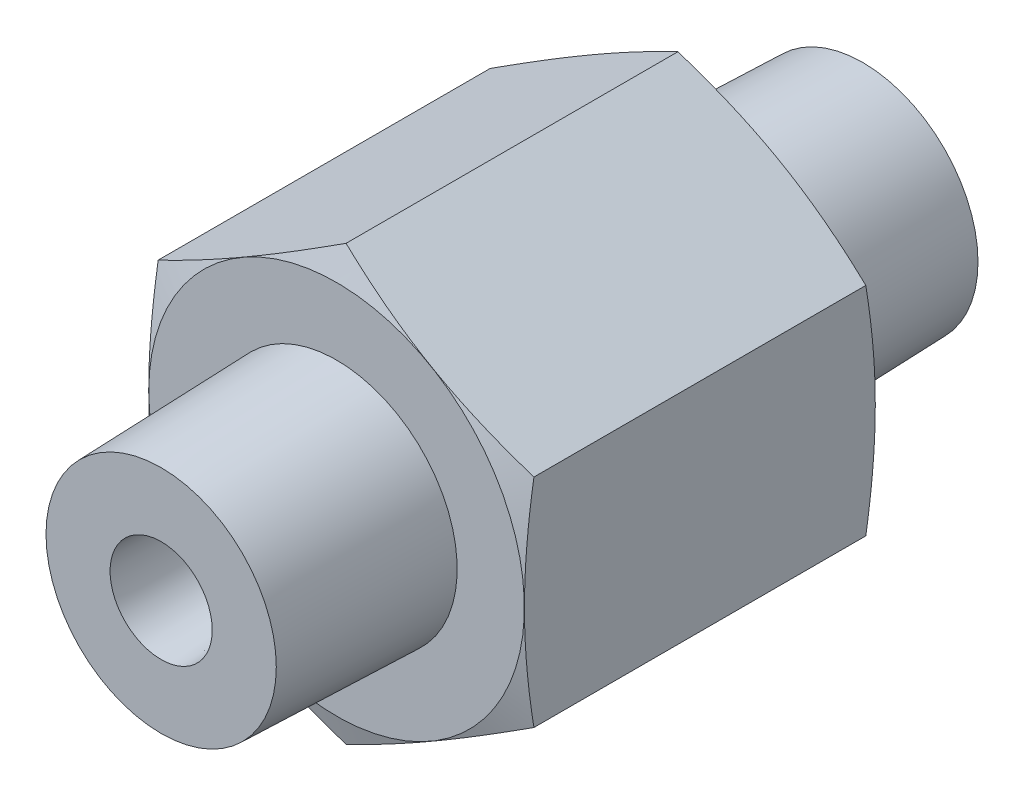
ISO-10303-21;
HEADER;
FILE_DESCRIPTION(('STEP AP214'),'2;1');
FILE_NAME('part.step','',(''),(''),'','','');
FILE_SCHEMA(('AUTOMOTIVE_DESIGN { 1 0 10303 214 1 1 1 1 }'));
ENDSEC;
DATA;
#1=APPLICATION_CONTEXT('core data for automotive mechanical design processes');
#2=APPLICATION_PROTOCOL_DEFINITION('international standard','automotive_design',2000,#1);
#3=PRODUCT_CONTEXT('',#1,'mechanical');
#4=PRODUCT('Part','Part','',(#3));
#5=PRODUCT_RELATED_PRODUCT_CATEGORY('part','',(#4));
#6=PRODUCT_DEFINITION_FORMATION('','',#4);
#7=PRODUCT_DEFINITION_CONTEXT('part definition',#1,'design');
#8=PRODUCT_DEFINITION('design','',#6,#7);
#9=PRODUCT_DEFINITION_SHAPE('','',#8);
#10=(LENGTH_UNIT() NAMED_UNIT(*) SI_UNIT(.MILLI.,.METRE.));
#11=(NAMED_UNIT(*) PLANE_ANGLE_UNIT() SI_UNIT($,.RADIAN.));
#12=(NAMED_UNIT(*) SI_UNIT($,.STERADIAN.) SOLID_ANGLE_UNIT());
#13=UNCERTAINTY_MEASURE_WITH_UNIT(LENGTH_MEASURE(1.E-05),#10,'distance_accuracy_value','');
#14=(GEOMETRIC_REPRESENTATION_CONTEXT(3) GLOBAL_UNCERTAINTY_ASSIGNED_CONTEXT((#13)) GLOBAL_UNIT_ASSIGNED_CONTEXT((#10,
#11,#12)) REPRESENTATION_CONTEXT('',''));
#15=CARTESIAN_POINT('',(0.,0.,0.));
#16=DIRECTION('',(0.,0.,1.));
#17=DIRECTION('',(1.,0.,0.));
#18=AXIS2_PLACEMENT_3D('',#15,#16,#17);
#19=CARTESIAN_POINT('',(-6.03249999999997,-33.4507708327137,0.));
#20=DIRECTION('',(0.5,-0.866025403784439,0.));
#21=DIRECTION('',(0.866025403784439,0.5,0.));
#22=AXIS2_PLACEMENT_3D('',#19,#20,#21);
#23=PLANE('',#22);
#24=CARTESIAN_POINT('',(-12.8328840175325,-37.3769743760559,12.3564425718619));
#25=CARTESIAN_POINT('',(-12.5509277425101,-37.2141868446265,12.4095177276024));
#26=CARTESIAN_POINT('',(-12.2682212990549,-37.0509662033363,12.4577566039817));
#27=CARTESIAN_POINT('',(-11.7013331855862,-36.7236731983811,12.5425743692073));
#28=CARTESIAN_POINT('',(-11.4171507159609,-36.55960037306,12.5791460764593));
#29=CARTESIAN_POINT('',(-10.8498479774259,-36.2320679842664,12.6383459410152));
#30=CARTESIAN_POINT('',(-10.5667360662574,-36.0686132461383,12.6610780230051));
#31=CARTESIAN_POINT('',(-9.99997999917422,-35.7413964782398,12.6915643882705));
#32=CARTESIAN_POINT('',(-9.71633602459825,-35.5776345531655,12.6993230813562));
#33=CARTESIAN_POINT('',(-9.14904807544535,-35.2501107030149,12.6993230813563));
#34=CARTESIAN_POINT('',(-8.86540410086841,-35.0863487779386,12.6915643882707));
#35=CARTESIAN_POINT('',(-8.29864803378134,-34.7591320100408,12.661078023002));
#36=CARTESIAN_POINT('',(-8.01553612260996,-34.5956772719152,12.6383459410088));
#37=CARTESIAN_POINT('',(-7.4482333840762,-34.2681448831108,12.5791460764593));
#38=CARTESIAN_POINT('',(-7.16405091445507,-34.1040720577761,12.542574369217));
#39=CARTESIAN_POINT('',(-6.5971628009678,-33.7767790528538,12.4577566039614));
#40=CARTESIAN_POINT('',(-6.31445635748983,-33.6135584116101,12.4095177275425));
#41=CARTESIAN_POINT('',(-6.03250008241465,-33.4507708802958,12.3564425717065));
#42=B_SPLINE_CURVE_WITH_KNOTS('',3,(#24,#25,#26,#27,#28,#29,#30,#31,#32,#33,#34,#35,#36,#37,#38,
#39,#40,#41),.UNSPECIFIED.,.F.,.F.,(4,2,2,2,2,2,2,2,4),(0.,0.989698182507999,1.9800043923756,
2.96277938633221,3.94526489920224,4.9277504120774,5.91052540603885,6.90083161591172,
7.89052979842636),.UNSPECIFIED.);
#43=CARTESIAN_POINT('',(-12.8328840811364,-37.3769744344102,12.3564425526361));
#44=VERTEX_POINT('',#43);
#45=CARTESIAN_POINT('',(-6.03250004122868,-33.4507708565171,12.3564425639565));
#46=VERTEX_POINT('',#45);
#47=EDGE_CURVE('E20',#44,#46,#42,.T.);
#48=ORIENTED_EDGE('',*,*,#47,.F.);
#49=DIRECTION('',(0.,0.,1.));
#50=VECTOR('',#49,1.);
#51=CARTESIAN_POINT('',(-12.8328841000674,-37.3769744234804,0.));
#52=LINE('',#51,#50);
#53=CARTESIAN_POINT('',(-12.8328840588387,-37.376974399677,0.343557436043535));
#54=VERTEX_POINT('',#53);
#55=EDGE_CURVE('E72',#54,#44,#52,.T.);
#56=ORIENTED_EDGE('',*,*,#55,.F.);
#57=CARTESIAN_POINT('',(-6.0325000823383,-33.4507708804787,0.343557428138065));
#58=CARTESIAN_POINT('',(-6.31445635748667,-33.6135584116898,0.290482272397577));
#59=CARTESIAN_POINT('',(-6.59716280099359,-33.7767790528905,0.242243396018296));
#60=CARTESIAN_POINT('',(-7.1640509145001,-34.1040720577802,0.157425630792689));
#61=CARTESIAN_POINT('',(-7.44823338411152,-34.2681448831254,0.120853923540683));
#62=CARTESIAN_POINT('',(-8.01553612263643,-34.5956772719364,0.0616540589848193));
#63=CARTESIAN_POINT('',(-8.29864803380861,-34.7591320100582,0.0389219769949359));
#64=CARTESIAN_POINT('',(-8.86540410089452,-35.086348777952,0.00843561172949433));
#65=CARTESIAN_POINT('',(-9.1490480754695,-35.250110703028,0.000676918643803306));
#66=CARTESIAN_POINT('',(-9.71633602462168,-35.5776345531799,0.000676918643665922));
#67=CARTESIAN_POINT('',(-9.99997999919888,-35.7413964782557,0.00843561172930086));
#68=CARTESIAN_POINT('',(-10.5667360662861,-36.0686132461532,0.0389219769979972));
#69=CARTESIAN_POINT('',(-10.8498479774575,-36.2320679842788,0.0616540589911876));
#70=CARTESIAN_POINT('',(-11.4171507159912,-36.5596003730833,0.120853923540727));
#71=CARTESIAN_POINT('',(-11.7013331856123,-36.723673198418,0.157425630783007));
#72=CARTESIAN_POINT('',(-12.2682212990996,-37.0509662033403,0.242243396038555));
#73=CARTESIAN_POINT('',(-12.5509277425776,-37.2141868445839,0.29048227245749));
#74=CARTESIAN_POINT('',(-12.8328840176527,-37.3769743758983,0.343557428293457));
#75=B_SPLINE_CURVE_WITH_KNOTS('',3,(#57,#58,#59,#60,#61,#62,#63,#64,#65,#66,#67,#68,#69,#70,#71,
#72,#73,#74),.UNSPECIFIED.,.F.,.F.,(4,2,2,2,2,2,2,2,4),(0.,0.989698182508,1.9800043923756,
2.96277938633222,3.94526489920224,4.9277504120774,5.91052540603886,6.90083161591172,
7.89052979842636),.UNSPECIFIED.);
#76=CARTESIAN_POINT('',(-6.03249999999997,-33.4507708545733,0.343557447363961));
#77=VERTEX_POINT('',#76);
#78=EDGE_CURVE('E89',#77,#54,#75,.T.);
#79=ORIENTED_EDGE('',*,*,#78,.F.);
#80=DIRECTION('',(0.,0.,-1.));
#81=VECTOR('',#80,1.);
#82=CARTESIAN_POINT('',(-6.03249999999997,-33.4507708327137,0.));
#83=LINE('',#82,#81);
#84=EDGE_CURVE('E87',#46,#77,#83,.T.);
#85=ORIENTED_EDGE('',*,*,#84,.F.);
#86=EDGE_LOOP('',(#48,#56,#79,#85));
#87=FACE_BOUND('',#86,.T.);
#88=ADVANCED_FACE('F16',(#87),#23,.T.);
#89=CARTESIAN_POINT('',(-12.8328841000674,-37.3769744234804,0.));
#90=DIRECTION('',(-0.5,-0.866025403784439,0.));
#91=DIRECTION('',(0.866025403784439,-0.5,0.));
#92=AXIS2_PLACEMENT_3D('',#89,#90,#91);
#93=PLANE('',#92);
#94=CARTESIAN_POINT('',(-19.6332682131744,-33.4507707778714,12.3564425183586));
#95=CARTESIAN_POINT('',(-19.351311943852,-33.6135583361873,12.4095176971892));
#96=CARTESIAN_POINT('',(-19.0686054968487,-33.7767789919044,12.4577565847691));
#97=CARTESIAN_POINT('',(-18.5017173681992,-34.1040720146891,12.5425743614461));
#98=CARTESIAN_POINT('',(-18.2175348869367,-34.2681448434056,12.5791460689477));
#99=CARTESIAN_POINT('',(-17.6502321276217,-34.5956772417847,12.6383459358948));
#100=CARTESIAN_POINT('',(-17.367120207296,-34.7591319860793,12.6610780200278));
#101=CARTESIAN_POINT('',(-16.8003641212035,-35.0863487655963,12.6915643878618));
#102=CARTESIAN_POINT('',(-16.5167201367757,-35.2501106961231,12.6993230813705));
#103=CARTESIAN_POINT('',(-15.9494321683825,-35.5776345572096,12.699323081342));
#104=CARTESIAN_POINT('',(-15.6657881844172,-35.7413964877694,12.6915643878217));
#105=CARTESIAN_POINT('',(-15.099032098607,-36.0686132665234,12.6610780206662));
#106=CARTESIAN_POINT('',(-14.8159201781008,-36.2320680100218,12.6383459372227));
#107=CARTESIAN_POINT('',(-14.2486174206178,-36.5596004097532,12.5791460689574));
#108=CARTESIAN_POINT('',(-13.9644349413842,-36.723673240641,12.5425743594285));
#109=CARTESIAN_POINT('',(-13.3975468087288,-37.0509662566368,12.4577565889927));
#110=CARTESIAN_POINT('',(-13.1148403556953,-37.2141869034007,12.4095177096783));
#111=CARTESIAN_POINT('',(-12.8328840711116,-37.3769744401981,12.3564425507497));
#112=B_SPLINE_CURVE_WITH_KNOTS('',3,(#94,#95,#96,#97,#98,#99,#100,#101,#102,#103,#104,#105,#106,
#107,#108,#109,#110,#111),.UNSPECIFIED.,.F.,.F.,(4,2,2,2,2,2,2,2,4),(0.,0.989698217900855,
1.98000446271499,2.96277949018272,3.94526503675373,4.92775058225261,5.91052560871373,
6.90083185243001,7.89053006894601),.UNSPECIFIED.);
#113=CARTESIAN_POINT('',(-19.6332682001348,-33.4507707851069,12.3564425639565));
#114=VERTEX_POINT('',#113);
#115=EDGE_CURVE('E85',#114,#44,#112,.T.);
#116=ORIENTED_EDGE('',*,*,#115,.F.);
#117=DIRECTION('',(0.,0.,1.));
#118=VECTOR('',#117,1.);
#119=CARTESIAN_POINT('',(-19.6332682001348,-33.4507708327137,0.));
#120=LINE('',#119,#118);
#121=CARTESIAN_POINT('',(-19.6332681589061,-33.4507708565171,0.343557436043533));
#122=VERTEX_POINT('',#121);
#123=EDGE_CURVE('E187',#122,#114,#120,.T.);
#124=ORIENTED_EDGE('',*,*,#123,.F.);
#125=CARTESIAN_POINT('',(-12.8328840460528,-37.376974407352,0.343557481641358));
#126=CARTESIAN_POINT('',(-13.1148403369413,-37.2141868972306,0.290482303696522));
#127=CARTESIAN_POINT('',(-13.3975467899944,-37.0509662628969,0.242243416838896));
#128=CARTESIAN_POINT('',(-13.9644349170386,-36.723673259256,0.157425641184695));
#129=CARTESIAN_POINT('',(-14.2486173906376,-36.5596004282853,0.120853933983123));
#130=CARTESIAN_POINT('',(-14.8159201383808,-36.2320680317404,0.0616540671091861));
#131=CARTESIAN_POINT('',(-15.0990320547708,-36.0686132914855,0.0389219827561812));
#132=CARTESIAN_POINT('',(-15.6657881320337,-35.7413965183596,0.0084356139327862));
#133=CARTESIAN_POINT('',(-15.9494321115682,-35.5776345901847,0.000676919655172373));
#134=CARTESIAN_POINT('',(-16.5167200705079,-35.2501107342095,0.000676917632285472));
#135=CARTESIAN_POINT('',(-16.8003640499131,-35.0863488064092,0.00843560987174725));
#136=CARTESIAN_POINT('',(-17.367120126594,-34.7591320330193,0.0389219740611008));
#137=CARTESIAN_POINT('',(-17.650232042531,-34.5956772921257,0.0616540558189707));
#138=CARTESIAN_POINT('',(-18.2175347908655,-34.2681448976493,0.120853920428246));
#139=CARTESIAN_POINT('',(-18.5017172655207,-34.1040720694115,0.157425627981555));
#140=CARTESIAN_POINT('',(-19.0686053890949,-33.7767790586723,0.24224339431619));
#141=CARTESIAN_POINT('',(-19.3513118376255,-33.6135584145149,0.290482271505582));
#142=CARTESIAN_POINT('',(-19.6332681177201,-33.4507708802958,0.34355742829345));
#143=B_SPLINE_CURVE_WITH_KNOTS('',3,(#125,#126,#127,#128,#129,#130,#131,#132,#133,#134,#135,
#136,#137,#138,#139,#140,#141,#142),.UNSPECIFIED.,.F.,.F.,(4,2,2,2,2,2,2,2,4),(0.,
0.989698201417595,1.98000442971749,2.96277944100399,3.94526497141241,4.92775050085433,
5.91052551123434,6.90083173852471,7.89052993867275),.UNSPECIFIED.);
#144=EDGE_CURVE('E138',#54,#122,#143,.T.);
#145=ORIENTED_EDGE('',*,*,#144,.F.);
#146=ORIENTED_EDGE('',*,*,#55,.T.);
#147=EDGE_LOOP('',(#116,#124,#145,#146));
#148=FACE_BOUND('',#147,.T.);
#149=ADVANCED_FACE('F160',(#148),#93,.T.);
#150=CARTESIAN_POINT('',(-19.6332682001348,-33.4507708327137,0.));
#151=DIRECTION('',(-1.,0.,0.));
#152=DIRECTION('',(0.,0.,1.));
#153=AXIS2_PLACEMENT_3D('',#150,#151,#152);
#154=PLANE('',#153);
#155=CARTESIAN_POINT('',(-19.6332681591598,-25.5983636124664,12.3564425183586));
#156=CARTESIAN_POINT('',(-19.6332681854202,-25.9239386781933,12.4095176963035));
#157=CARTESIAN_POINT('',(-19.6332681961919,-26.2503799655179,12.4577565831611));
#158=CARTESIAN_POINT('',(-19.6332682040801,-26.9049659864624,12.5425743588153));
#159=CARTESIAN_POINT('',(-19.6332682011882,-27.2331116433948,12.5791460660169));
#160=CARTESIAN_POINT('',(-19.6332681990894,-27.8881764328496,12.6383459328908));
#161=CARTESIAN_POINT('',(-19.6332681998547,-28.2150859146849,12.6610780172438));
#162=CARTESIAN_POINT('',(-19.6332682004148,-28.8695194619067,12.6915643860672));
#163=CARTESIAN_POINT('',(-19.6332682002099,-29.1970433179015,12.6993230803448));
#164=CARTESIAN_POINT('',(-19.6332682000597,-29.852091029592,12.6993230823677));
#165=CARTESIAN_POINT('',(-19.6332682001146,-30.1796148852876,12.6915643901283));
#166=CARTESIAN_POINT('',(-19.633268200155,-30.8340484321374,12.6610780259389));
#167=CARTESIAN_POINT('',(-19.6332682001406,-31.1609579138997,12.638345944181));
#168=CARTESIAN_POINT('',(-19.633268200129,-31.8160227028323,12.5791460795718));
#169=CARTESIAN_POINT('',(-19.6332682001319,-32.1441683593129,12.5425743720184));
#170=CARTESIAN_POINT('',(-19.6332682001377,-32.7987543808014,12.4577566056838));
#171=CARTESIAN_POINT('',(-19.6332682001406,-33.1251956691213,12.4095177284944));
#172=CARTESIAN_POINT('',(-19.6332682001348,-33.4507707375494,12.3564425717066));
#173=B_SPLINE_CURVE_WITH_KNOTS('',3,(#155,#156,#157,#158,#159,#160,#161,#162,#163,#164,#165,
#166,#167,#168,#169,#170,#171,#172),.UNSPECIFIED.,.F.,.F.,(4,2,2,2,2,2,2,2,4),(0.,
0.989698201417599,1.9800044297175,2.96277944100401,3.94526497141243,4.92775050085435,
5.91052551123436,6.90083173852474,7.89052993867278),.UNSPECIFIED.);
#174=CARTESIAN_POINT('',(-19.6332681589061,-25.5983636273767,12.3564425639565));
#175=VERTEX_POINT('',#174);
#176=EDGE_CURVE('E166',#175,#114,#173,.T.);
#177=ORIENTED_EDGE('',*,*,#176,.F.);
#178=DIRECTION('',(0.,0.,1.));
#179=VECTOR('',#178,1.);
#180=CARTESIAN_POINT('',(-19.6332682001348,-25.5983636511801,0.));
#181=LINE('',#180,#179);
#182=CARTESIAN_POINT('',(-19.6332682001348,-25.5983636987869,0.343557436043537));
#183=VERTEX_POINT('',#182);
#184=EDGE_CURVE('E184',#183,#175,#181,.T.);
#185=ORIENTED_EDGE('',*,*,#184,.F.);
#186=CARTESIAN_POINT('',(-19.6332681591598,-33.4507708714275,0.343557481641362));
#187=CARTESIAN_POINT('',(-19.6332681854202,-33.1251958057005,0.290482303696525));
#188=CARTESIAN_POINT('',(-19.6332681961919,-32.7987545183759,0.242243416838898));
#189=CARTESIAN_POINT('',(-19.6332682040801,-32.1441684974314,0.157425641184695));
#190=CARTESIAN_POINT('',(-19.6332682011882,-31.816022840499,0.120853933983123));
#191=CARTESIAN_POINT('',(-19.6332681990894,-31.1609580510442,0.0616540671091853));
#192=CARTESIAN_POINT('',(-19.6332681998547,-30.834048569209,0.03892198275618));
#193=CARTESIAN_POINT('',(-19.6332682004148,-30.1796150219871,0.0084356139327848));
#194=CARTESIAN_POINT('',(-19.6332682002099,-29.8520911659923,0.000676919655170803));
#195=CARTESIAN_POINT('',(-19.6332682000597,-29.1970434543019,0.000676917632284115));
#196=CARTESIAN_POINT('',(-19.6332682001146,-28.8695195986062,0.00843560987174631));
#197=CARTESIAN_POINT('',(-19.633268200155,-28.2150860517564,0.0389219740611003));
#198=CARTESIAN_POINT('',(-19.6332682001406,-27.8881765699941,0.0616540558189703));
#199=CARTESIAN_POINT('',(-19.633268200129,-27.2331117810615,0.120853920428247));
#200=CARTESIAN_POINT('',(-19.6332682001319,-26.9049661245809,0.157425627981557));
#201=CARTESIAN_POINT('',(-19.6332682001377,-26.2503801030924,0.242243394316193));
#202=CARTESIAN_POINT('',(-19.6332682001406,-25.9239388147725,0.290482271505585));
#203=CARTESIAN_POINT('',(-19.6332682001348,-25.5983637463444,0.343557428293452));
#204=B_SPLINE_CURVE_WITH_KNOTS('',3,(#186,#187,#188,#189,#190,#191,#192,#193,#194,#195,#196,
#197,#198,#199,#200,#201,#202,#203),.UNSPECIFIED.,.F.,.F.,(4,2,2,2,2,2,2,2,4),(0.,
0.9896982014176,1.9800044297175,2.96277944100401,3.94526497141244,4.92775050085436,
5.91052551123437,6.90083173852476,7.8905299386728),.UNSPECIFIED.);
#205=EDGE_CURVE('E151',#122,#183,#204,.T.);
#206=ORIENTED_EDGE('',*,*,#205,.F.);
#207=ORIENTED_EDGE('',*,*,#123,.T.);
#208=EDGE_LOOP('',(#177,#185,#206,#207));
#209=FACE_BOUND('',#208,.T.);
#210=ADVANCED_FACE('F156',(#209),#154,.T.);
#211=CARTESIAN_POINT('',(-19.6332682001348,-25.5983636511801,0.));
#212=DIRECTION('',(-0.500000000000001,0.866025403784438,0.));
#213=DIRECTION('',(-0.866025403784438,-0.500000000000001,0.));
#214=AXIS2_PLACEMENT_3D('',#211,#212,#213);
#215=PLANE('',#214);
#216=CARTESIAN_POINT('',(-12.832884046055,-21.6721600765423,12.3564425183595));
#217=CARTESIAN_POINT('',(-13.1148403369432,-21.834947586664,12.409517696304));
#218=CARTESIAN_POINT('',(-13.3975467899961,-21.9981682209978,12.4577565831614));
#219=CARTESIAN_POINT('',(-13.9644349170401,-22.3254612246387,12.5425743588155));
#220=CARTESIAN_POINT('',(-14.2486173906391,-22.4895340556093,12.579146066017));
#221=CARTESIAN_POINT('',(-14.8159201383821,-22.8170664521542,12.6383459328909));
#222=CARTESIAN_POINT('',(-15.099032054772,-22.980521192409,12.6610780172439));
#223=CARTESIAN_POINT('',(-15.6657881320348,-23.3077379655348,12.6915643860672));
#224=CARTESIAN_POINT('',(-15.9494321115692,-23.4714998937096,12.6993230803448));
#225=CARTESIAN_POINT('',(-16.5167200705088,-23.7990237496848,12.6993230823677));
#226=CARTESIAN_POINT('',(-16.8003640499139,-23.962785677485,12.6915643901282));
#227=CARTESIAN_POINT('',(-17.3671201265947,-24.2900024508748,12.6610780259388));
#228=CARTESIAN_POINT('',(-17.6502320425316,-24.4534571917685,12.638345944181));
#229=CARTESIAN_POINT('',(-18.2175347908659,-24.7809895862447,12.5791460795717));
#230=CARTESIAN_POINT('',(-18.501717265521,-24.9450624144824,12.5425743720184));
#231=CARTESIAN_POINT('',(-19.068605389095,-25.2723554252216,12.4577566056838));
#232=CARTESIAN_POINT('',(-19.3513118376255,-25.4355760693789,12.4095177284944));
#233=CARTESIAN_POINT('',(-19.6332681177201,-25.598363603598,12.3564425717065));
#234=B_SPLINE_CURVE_WITH_KNOTS('',3,(#216,#217,#218,#219,#220,#221,#222,#223,#224,#225,#226,
#227,#228,#229,#230,#231,#232,#233),.UNSPECIFIED.,.F.,.F.,(4,2,2,2,2,2,2,2,4),(0.,
0.989698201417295,1.98000442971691,2.96277944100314,3.94526497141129,4.92775050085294,
5.9105255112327,6.9008317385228,7.89052993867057),.UNSPECIFIED.);
#235=CARTESIAN_POINT('',(-12.8328840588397,-21.6721600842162,12.3564425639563));
#236=VERTEX_POINT('',#235);
#237=EDGE_CURVE('E96',#236,#175,#234,.T.);
#238=ORIENTED_EDGE('',*,*,#237,.F.);
#239=DIRECTION('',(0.,0.,1.));
#240=VECTOR('',#239,1.);
#241=CARTESIAN_POINT('',(-12.8328841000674,-21.6721600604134,0.));
#242=LINE('',#241,#240);
#243=CARTESIAN_POINT('',(-12.8328841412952,-21.6721600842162,0.343557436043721));
#244=VERTEX_POINT('',#243);
#245=EDGE_CURVE('E189',#244,#236,#242,.T.);
#246=ORIENTED_EDGE('',*,*,#245,.F.);
#247=CARTESIAN_POINT('',(-19.6332682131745,-25.5983637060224,0.343557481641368));
#248=CARTESIAN_POINT('',(-19.3513119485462,-25.4355761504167,0.290482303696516));
#249=CARTESIAN_POINT('',(-19.0686055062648,-25.2723554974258,0.242243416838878));
#250=CARTESIAN_POINT('',(-18.5017173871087,-24.9450624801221,0.157425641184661));
#251=CARTESIAN_POINT('',(-18.2175349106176,-24.7809896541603,0.120853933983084));
#252=CARTESIAN_POINT('',(-17.6502321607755,-24.4534572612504,0.0616540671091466));
#253=CARTESIAN_POINT('',(-17.3671202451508,-24.29000251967,0.0389219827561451));
#254=CARTESIAN_POINT('',(-16.8003641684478,-23.9627857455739,0.00843561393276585));
#255=CARTESIAN_POINT('',(-16.5167201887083,-23.799023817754,0.000676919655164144));
#256=CARTESIAN_POINT('',(-15.9494322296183,-23.4714999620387,0.00067691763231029));
#257=CARTESIAN_POINT('',(-15.6657882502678,-23.3077380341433,0.00843560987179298));
#258=CARTESIAN_POINT('',(-15.0990321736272,-22.9805212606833,0.0389219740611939));
#259=CARTESIAN_POINT('',(-14.8159202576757,-22.8170665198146,0.0616540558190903));
#260=CARTESIAN_POINT('',(-14.2486175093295,-22.4895341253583,0.120853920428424));
#261=CARTESIAN_POINT('',(-13.9644350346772,-22.3254612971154,0.157425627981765));
#262=CARTESIAN_POINT('',(-13.3975469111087,-21.998168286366,0.242243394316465));
#263=CARTESIAN_POINT('',(-13.1148404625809,-21.8349476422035,0.29048227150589));
#264=CARTESIAN_POINT('',(-12.8328841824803,-21.6721601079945,0.343557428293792));
#265=B_SPLINE_CURVE_WITH_KNOTS('',3,(#247,#248,#249,#250,#251,#252,#253,#254,#255,#256,#257,
#258,#259,#260,#261,#262,#263,#264),.UNSPECIFIED.,.F.,.F.,(4,2,2,2,2,2,2,2,4),(0.,
0.989698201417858,1.98000442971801,2.96277944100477,3.94526497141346,4.92775050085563,
5.91052551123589,6.90083173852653,7.89052993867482),.UNSPECIFIED.);
#266=EDGE_CURVE('E147',#183,#244,#265,.T.);
#267=ORIENTED_EDGE('',*,*,#266,.F.);
#268=ORIENTED_EDGE('',*,*,#184,.T.);
#269=EDGE_LOOP('',(#238,#246,#267,#268));
#270=FACE_BOUND('',#269,.T.);
#271=ADVANCED_FACE('F159',(#270),#215,.T.);
#272=CARTESIAN_POINT('',(-12.8328841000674,-21.6721600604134,0.));
#273=DIRECTION('',(0.499999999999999,0.866025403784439,0.));
#274=DIRECTION('',(-0.866025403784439,0.499999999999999,0.));
#275=AXIS2_PLACEMENT_3D('',#272,#273,#274);
#276=PLANE('',#275);
#277=CARTESIAN_POINT('',(-6.03249998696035,-25.5983637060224,12.3564425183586));
#278=CARTESIAN_POINT('',(-6.3144562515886,-25.4355761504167,12.4095176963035));
#279=CARTESIAN_POINT('',(-6.59716269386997,-25.2723554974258,12.4577565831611));
#280=CARTESIAN_POINT('',(-7.16405081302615,-24.9450624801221,12.5425743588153));
#281=CARTESIAN_POINT('',(-7.4482332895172,-24.7809896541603,12.5791460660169));
#282=CARTESIAN_POINT('',(-8.0155360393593,-24.4534572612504,12.6383459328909));
#283=CARTESIAN_POINT('',(-8.29864795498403,-24.29000251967,12.6610780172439));
#284=CARTESIAN_POINT('',(-8.86540403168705,-23.9627857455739,12.6915643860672));
#285=CARTESIAN_POINT('',(-9.14904801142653,-23.799023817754,12.6993230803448));
#286=CARTESIAN_POINT('',(-9.7163359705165,-23.4714999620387,12.6993230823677));
#287=CARTESIAN_POINT('',(-9.999979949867,-23.3077380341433,12.6915643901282));
#288=CARTESIAN_POINT('',(-10.5667360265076,-22.9805212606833,12.6610780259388));
#289=CARTESIAN_POINT('',(-10.8498479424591,-22.8170665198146,12.6383459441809));
#290=CARTESIAN_POINT('',(-11.4171506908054,-22.4895341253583,12.5791460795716));
#291=CARTESIAN_POINT('',(-11.7013331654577,-22.3254612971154,12.5425743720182));
#292=CARTESIAN_POINT('',(-12.2682212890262,-21.998168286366,12.4577566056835));
#293=CARTESIAN_POINT('',(-12.5509277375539,-21.8349476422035,12.4095177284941));
#294=CARTESIAN_POINT('',(-12.8328840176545,-21.6721601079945,12.3564425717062));
#295=B_SPLINE_CURVE_WITH_KNOTS('',3,(#277,#278,#279,#280,#281,#282,#283,#284,#285,#286,#287,
#288,#289,#290,#291,#292,#293,#294),.UNSPECIFIED.,.F.,.F.,(4,2,2,2,2,2,2,2,4),(0.,
0.989698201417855,1.98000442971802,2.96277944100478,3.94526497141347,4.92775050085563,
5.9105255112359,6.90083173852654,7.89052993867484),.UNSPECIFIED.);
#296=CARTESIAN_POINT('',(-6.03249999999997,-25.5983636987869,12.3564425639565));
#297=VERTEX_POINT('',#296);
#298=EDGE_CURVE('E95',#297,#236,#295,.T.);
#299=ORIENTED_EDGE('',*,*,#298,.F.);
#300=DIRECTION('',(0.,0.,-1.));
#301=VECTOR('',#300,1.);
#302=CARTESIAN_POINT('',(-6.03249999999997,-25.5983636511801,0.));
#303=LINE('',#302,#301);
#304=CARTESIAN_POINT('',(-6.03250004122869,-25.5983636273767,0.343557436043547));
#305=VERTEX_POINT('',#304);
#306=EDGE_CURVE('E92',#305,#297,#303,.F.);
#307=ORIENTED_EDGE('',*,*,#306,.F.);
#308=CARTESIAN_POINT('',(-12.8328841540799,-21.6721600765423,0.343557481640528));
#309=CARTESIAN_POINT('',(-12.5509278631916,-21.834947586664,0.290482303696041));
#310=CARTESIAN_POINT('',(-12.2682214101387,-21.9981682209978,0.242243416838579));
#311=CARTESIAN_POINT('',(-11.7013332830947,-22.3254612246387,0.157425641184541));
#312=CARTESIAN_POINT('',(-11.4171508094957,-22.4895340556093,0.120853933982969));
#313=CARTESIAN_POINT('',(-10.8498480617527,-22.8170664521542,0.061654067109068));
#314=CARTESIAN_POINT('',(-10.5667361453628,-22.980521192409,0.0389219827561));
#315=CARTESIAN_POINT('',(-9.99998006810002,-23.3077379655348,0.00843561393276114));
#316=CARTESIAN_POINT('',(-9.71633608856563,-23.4714998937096,0.000676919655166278));
#317=CARTESIAN_POINT('',(-9.14904812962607,-23.7990237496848,0.000676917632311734));
#318=CARTESIAN_POINT('',(-8.86540415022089,-23.962785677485,0.00843560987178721));
#319=CARTESIAN_POINT('',(-8.29864807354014,-24.2900024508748,0.0389219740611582));
#320=CARTESIAN_POINT('',(-8.01553615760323,-24.4534571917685,0.0616540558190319));
#321=CARTESIAN_POINT('',(-7.44823340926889,-24.7809895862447,0.120853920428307));
#322=CARTESIAN_POINT('',(-7.16405093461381,-24.9450624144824,0.157425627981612));
#323=CARTESIAN_POINT('',(-6.59716281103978,-25.2723554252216,0.242243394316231));
#324=CARTESIAN_POINT('',(-6.31445636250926,-25.4355760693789,0.290482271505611));
#325=CARTESIAN_POINT('',(-6.03250008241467,-25.598363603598,0.343557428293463));
#326=B_SPLINE_CURVE_WITH_KNOTS('',3,(#308,#309,#310,#311,#312,#313,#314,#315,#316,#317,#318,
#319,#320,#321,#322,#323,#324,#325),.UNSPECIFIED.,.F.,.F.,(4,2,2,2,2,2,2,2,4),(0.,
0.989698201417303,1.98000442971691,2.96277944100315,3.9452649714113,4.92775050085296,
5.91052551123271,6.90083173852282,7.89052993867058),.UNSPECIFIED.);
#327=EDGE_CURVE('E39',#244,#305,#326,.T.);
#328=ORIENTED_EDGE('',*,*,#327,.F.);
#329=ORIENTED_EDGE('',*,*,#245,.T.);
#330=EDGE_LOOP('',(#299,#307,#328,#329));
#331=FACE_BOUND('',#330,.T.);
#332=ADVANCED_FACE('F111',(#331),#276,.T.);
#333=CARTESIAN_POINT('',(-6.03249999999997,-25.5983636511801,0.));
#334=DIRECTION('',(1.,0.,0.));
#335=DIRECTION('',(0.,0.,-1.));
#336=AXIS2_PLACEMENT_3D('',#333,#334,#335);
#337=PLANE('',#336);
#338=CARTESIAN_POINT('',(-6.03250004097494,-33.4507708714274,12.3564425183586));
#339=CARTESIAN_POINT('',(-6.03250001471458,-33.1251958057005,12.4095176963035));
#340=CARTESIAN_POINT('',(-6.03250000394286,-32.7987545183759,12.4577565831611));
#341=CARTESIAN_POINT('',(-6.03249999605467,-32.1441684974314,12.5425743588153));
#342=CARTESIAN_POINT('',(-6.03249999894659,-31.816022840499,12.5791460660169));
#343=CARTESIAN_POINT('',(-6.03250000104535,-31.1609580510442,12.6383459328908));
#344=CARTESIAN_POINT('',(-6.03250000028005,-30.8340485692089,12.6610780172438));
#345=CARTESIAN_POINT('',(-6.03249999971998,-30.1796150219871,12.6915643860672));
#346=CARTESIAN_POINT('',(-6.03249999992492,-29.8520911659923,12.6993230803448));
#347=CARTESIAN_POINT('',(-6.03250000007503,-29.1970434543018,12.6993230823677));
#348=CARTESIAN_POINT('',(-6.03250000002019,-28.8695195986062,12.6915643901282));
#349=CARTESIAN_POINT('',(-6.03249999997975,-28.2150860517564,12.6610780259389));
#350=CARTESIAN_POINT('',(-6.03249999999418,-27.8881765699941,12.638345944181));
#351=CARTESIAN_POINT('',(-6.03250000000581,-27.2331117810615,12.5791460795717));
#352=CARTESIAN_POINT('',(-6.03250000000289,-26.9049661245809,12.5425743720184));
#353=CARTESIAN_POINT('',(-6.03249999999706,-26.2503801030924,12.4577566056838));
#354=CARTESIAN_POINT('',(-6.03249999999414,-25.9239388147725,12.4095177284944));
#355=CARTESIAN_POINT('',(-6.03249999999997,-25.5983637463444,12.3564425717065));
#356=B_SPLINE_CURVE_WITH_KNOTS('',3,(#338,#339,#340,#341,#342,#343,#344,#345,#346,#347,#348,
#349,#350,#351,#352,#353,#354,#355),.UNSPECIFIED.,.F.,.F.,(4,2,2,2,2,2,2,2,4),(0.,
0.989698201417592,1.98000442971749,2.96277944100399,3.94526497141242,4.92775050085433,
5.91052551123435,6.90083173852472,7.89052993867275),.UNSPECIFIED.);
#357=EDGE_CURVE('E83',#46,#297,#356,.T.);
#358=ORIENTED_EDGE('',*,*,#357,.F.);
#359=ORIENTED_EDGE('',*,*,#84,.T.);
#360=CARTESIAN_POINT('',(-6.03250004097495,-25.5983636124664,0.343557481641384));
#361=CARTESIAN_POINT('',(-6.03250001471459,-25.9239386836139,0.290482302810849));
#362=CARTESIAN_POINT('',(-6.03250000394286,-26.2503799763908,0.242243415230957));
#363=CARTESIAN_POINT('',(-6.03249999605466,-26.9049660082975,0.157425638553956));
#364=CARTESIAN_POINT('',(-6.03249999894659,-27.2331116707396,0.120853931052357));
#365=CARTESIAN_POINT('',(-6.03250000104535,-27.8881764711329,0.0616540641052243));
#366=CARTESIAN_POINT('',(-6.03250000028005,-28.2150859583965,0.038921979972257));
#367=CARTESIAN_POINT('',(-6.03249999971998,-28.8695195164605,0.00843561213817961));
#368=CARTESIAN_POINT('',(-6.03249999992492,-29.1970433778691,0.000676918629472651));
#369=CARTESIAN_POINT('',(-6.03250000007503,-29.8520911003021,0.000676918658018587));
#370=CARTESIAN_POINT('',(-6.03250000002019,-30.1796149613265,0.00843561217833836));
#371=CARTESIAN_POINT('',(-6.03249999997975,-30.8340485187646,0.0389219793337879));
#372=CARTESIAN_POINT('',(-6.03249999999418,-31.1609580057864,0.0616540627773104));
#373=CARTESIAN_POINT('',(-6.03250000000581,-31.8160228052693,0.120853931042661));
#374=CARTESIAN_POINT('',(-6.03250000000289,-32.1441684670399,0.157425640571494));
#375=CARTESIAN_POINT('',(-6.03249999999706,-32.7987544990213,0.242243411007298));
#376=CARTESIAN_POINT('',(-6.03249999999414,-33.1251957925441,0.290482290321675));
#377=CARTESIAN_POINT('',(-6.03249999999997,-33.4507708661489,0.343557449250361));
#378=B_SPLINE_CURVE_WITH_KNOTS('',3,(#360,#361,#362,#363,#364,#365,#366,#367,#368,#369,#370,
#371,#372,#373,#374,#375,#376,#377),.UNSPECIFIED.,.F.,.F.,(4,2,2,2,2,2,2,2,4),(0.,
0.989698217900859,1.980004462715,2.96277949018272,3.94526503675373,4.92775058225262,
5.91052560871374,6.90083185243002,7.89053006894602),.UNSPECIFIED.);
#379=EDGE_CURVE('E116',#305,#77,#378,.T.);
#380=ORIENTED_EDGE('',*,*,#379,.F.);
#381=ORIENTED_EDGE('',*,*,#306,.T.);
#382=EDGE_LOOP('',(#358,#359,#380,#381));
#383=FACE_BOUND('',#382,.T.);
#384=ADVANCED_FACE('F94',(#383),#337,.T.);
#385=CARTESIAN_POINT('',(-12.8328841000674,-29.5245672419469,12.3543812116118));
#386=DIRECTION('',(0.,0.,-1.));
#387=DIRECTION('',(-1.,0.,0.));
#388=AXIS2_PLACEMENT_3D('',#385,#386,#387);
#389=CONICAL_SURFACE('',#388,7.85873178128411,1.25572810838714);
#390=CARTESIAN_POINT('',(-12.8328841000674,-29.5245672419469,12.7000000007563));
#391=DIRECTION('',(0.,0.,-1.));
#392=DIRECTION('',(-1.,0.,0.));
#393=AXIS2_PLACEMENT_3D('',#390,#391,#392);
#394=CIRCLE('',#393,6.79830718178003);
#395=CARTESIAN_POINT('',(-19.6311912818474,-29.5245672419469,12.7000000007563));
#396=VERTEX_POINT('',#395);
#397=EDGE_CURVE('E122',#396,#396,#394,.F.);
#398=ORIENTED_EDGE('',*,*,#397,.F.);
#399=EDGE_LOOP('',(#398));
#400=FACE_BOUND('',#399,.T.);
#401=ORIENTED_EDGE('',*,*,#176,.T.);
#402=ORIENTED_EDGE('',*,*,#115,.T.);
#403=ORIENTED_EDGE('',*,*,#47,.T.);
#404=ORIENTED_EDGE('',*,*,#357,.T.);
#405=ORIENTED_EDGE('',*,*,#298,.T.);
#406=ORIENTED_EDGE('',*,*,#237,.T.);
#407=EDGE_LOOP('',(#401,#402,#403,#404,#405,#406));
#408=FACE_BOUND('',#407,.T.);
#409=ADVANCED_FACE('F80',(#400,#408),#389,.T.);
#410=CARTESIAN_POINT('',(-12.8328841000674,-29.5245672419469,0.345618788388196));
#411=DIRECTION('',(0.,0.,1.));
#412=DIRECTION('',(1.,0.,0.));
#413=AXIS2_PLACEMENT_3D('',#410,#411,#412);
#414=CONICAL_SURFACE('',#413,7.85873178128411,1.25572810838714);
#415=CARTESIAN_POINT('',(-12.8328841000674,-29.5245672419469,-7.56258879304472E-10));
#416=DIRECTION('',(0.,0.,1.));
#417=DIRECTION('',(1.,0.,0.));
#418=AXIS2_PLACEMENT_3D('',#415,#416,#417);
#419=CIRCLE('',#418,6.79830718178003);
#420=CARTESIAN_POINT('',(-6.03457691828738,-29.5245672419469,-7.56258855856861E-10));
#421=VERTEX_POINT('',#420);
#422=EDGE_CURVE('E210',#421,#421,#419,.T.);
#423=ORIENTED_EDGE('',*,*,#422,.T.);
#424=EDGE_LOOP('',(#423));
#425=FACE_BOUND('',#424,.T.);
#426=ORIENTED_EDGE('',*,*,#327,.T.);
#427=ORIENTED_EDGE('',*,*,#379,.T.);
#428=ORIENTED_EDGE('',*,*,#78,.T.);
#429=ORIENTED_EDGE('',*,*,#144,.T.);
#430=ORIENTED_EDGE('',*,*,#205,.T.);
#431=ORIENTED_EDGE('',*,*,#266,.T.);
#432=EDGE_LOOP('',(#426,#427,#428,#429,#430,#431));
#433=FACE_BOUND('',#432,.T.);
#434=ADVANCED_FACE('F128',(#425,#433),#414,.T.);
#435=CARTESIAN_POINT('',(-12.8328841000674,-29.5245672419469,12.7));
#436=DIRECTION('',(0.,0.,1.));
#437=DIRECTION('',(1.,0.,0.));
#438=AXIS2_PLACEMENT_3D('',#435,#436,#437);
#439=PLANE('',#438);
#440=CARTESIAN_POINT('',(-12.8328841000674,-29.5245672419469,12.6999999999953));
#441=DIRECTION('',(0.,0.,-1.));
#442=DIRECTION('',(-1.,0.,0.));
#443=AXIS2_PLACEMENT_3D('',#440,#441,#442);
#444=CIRCLE('',#443,4.36562388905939);
#445=CARTESIAN_POINT('',(-17.1985079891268,-29.5245672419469,12.6999999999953));
#446=VERTEX_POINT('',#445);
#447=EDGE_CURVE('E208',#446,#446,#444,.F.);
#448=ORIENTED_EDGE('',*,*,#447,.F.);
#449=EDGE_LOOP('',(#448));
#450=FACE_BOUND('',#449,.T.);
#451=ORIENTED_EDGE('',*,*,#397,.T.);
#452=EDGE_LOOP('',(#451));
#453=FACE_BOUND('',#452,.T.);
#454=ADVANCED_FACE('F132',(#450,#453),#439,.T.);
#455=CARTESIAN_POINT('',(-12.8328841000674,-29.5245672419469,0.));
#456=DIRECTION('',(0.,0.,1.));
#457=DIRECTION('',(1.,0.,0.));
#458=AXIS2_PLACEMENT_3D('',#455,#456,#457);
#459=PLANE('',#458);
#460=CARTESIAN_POINT('',(-12.8328841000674,-29.5245672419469,0.));
#461=DIRECTION('',(0.,0.,1.));
#462=DIRECTION('',(1.,0.,0.));
#463=AXIS2_PLACEMENT_3D('',#460,#461,#462);
#464=CIRCLE('',#463,4.36562388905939);
#465=CARTESIAN_POINT('',(-8.46726021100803,-29.5245672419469,0.));
#466=VERTEX_POINT('',#465);
#467=EDGE_CURVE('E205',#466,#466,#464,.F.);
#468=ORIENTED_EDGE('',*,*,#467,.F.);
#469=EDGE_LOOP('',(#468));
#470=FACE_BOUND('',#469,.T.);
#471=ORIENTED_EDGE('',*,*,#422,.F.);
#472=EDGE_LOOP('',(#471));
#473=FACE_BOUND('',#472,.T.);
#474=ADVANCED_FACE('F248',(#470,#473),#459,.F.);
#475=CARTESIAN_POINT('',(-12.8328841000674,-29.5245672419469,12.7000000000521));
#476=DIRECTION('',(0.,0.,-1.));
#477=DIRECTION('',(-1.,0.,0.));
#478=AXIS2_PLACEMENT_3D('',#475,#476,#477);
#479=CONICAL_SURFACE('',#478,4.36562388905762,0.0311244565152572);
#480=ORIENTED_EDGE('',*,*,#447,.T.);
#481=EDGE_LOOP('',(#480));
#482=FACE_BOUND('',#481,.T.);
#483=CARTESIAN_POINT('',(-12.8328841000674,-29.5245672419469,19.0499999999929));
#484=DIRECTION('',(0.,0.,-1.));
#485=DIRECTION('',(-1.,0.,0.));
#486=AXIS2_PLACEMENT_3D('',#483,#484,#485);
#487=CIRCLE('',#486,4.16791974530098);
#488=CARTESIAN_POINT('',(-17.0008038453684,-29.5245672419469,19.0499999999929));
#489=VERTEX_POINT('',#488);
#490=EDGE_CURVE('E202',#489,#489,#487,.T.);
#491=ORIENTED_EDGE('',*,*,#490,.T.);
#492=EDGE_LOOP('',(#491));
#493=FACE_BOUND('',#492,.T.);
#494=ADVANCED_FACE('F245',(#482,#493),#479,.T.);
#495=CARTESIAN_POINT('',(-12.8328841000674,-29.5245672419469,-5.6843418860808E-11));
#496=DIRECTION('',(0.,0.,1.));
#497=DIRECTION('',(1.,0.,0.));
#498=AXIS2_PLACEMENT_3D('',#495,#496,#497);
#499=CONICAL_SURFACE('',#498,4.36562388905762,0.0311244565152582);
#500=ORIENTED_EDGE('',*,*,#467,.T.);
#501=EDGE_LOOP('',(#500));
#502=FACE_BOUND('',#501,.T.);
#503=CARTESIAN_POINT('',(-12.8328841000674,-29.5245672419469,-6.34999999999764));
#504=DIRECTION('',(0.,0.,1.));
#505=DIRECTION('',(1.,0.,0.));
#506=AXIS2_PLACEMENT_3D('',#503,#504,#505);
#507=CIRCLE('',#506,4.16791974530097);
#508=CARTESIAN_POINT('',(-8.66496435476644,-29.5245672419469,-6.34999999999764));
#509=VERTEX_POINT('',#508);
#510=EDGE_CURVE('E199',#509,#509,#507,.F.);
#511=ORIENTED_EDGE('',*,*,#510,.F.);
#512=EDGE_LOOP('',(#511));
#513=FACE_BOUND('',#512,.T.);
#514=ADVANCED_FACE('F241',(#502,#513),#499,.T.);
#515=CARTESIAN_POINT('',(-12.8328841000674,-29.5245672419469,19.05));
#516=DIRECTION('',(0.,0.,-1.));
#517=DIRECTION('',(-1.,0.,0.));
#518=AXIS2_PLACEMENT_3D('',#515,#516,#517);
#519=PLANE('',#518);
#520=CARTESIAN_POINT('',(-12.8328841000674,-29.5245672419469,19.0499999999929));
#521=DIRECTION('',(0.,0.,1.));
#522=DIRECTION('',(1.,0.,0.));
#523=AXIS2_PLACEMENT_3D('',#520,#521,#522);
#524=CIRCLE('',#523,1.84870414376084);
#525=CARTESIAN_POINT('',(-10.9841799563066,-29.5245672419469,19.0499999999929));
#526=VERTEX_POINT('',#525);
#527=EDGE_CURVE('E196',#526,#526,#524,.F.);
#528=ORIENTED_EDGE('',*,*,#527,.T.);
#529=EDGE_LOOP('',(#528));
#530=FACE_BOUND('',#529,.T.);
#531=ORIENTED_EDGE('',*,*,#490,.F.);
#532=EDGE_LOOP('',(#531));
#533=FACE_BOUND('',#532,.T.);
#534=ADVANCED_FACE('F237',(#530,#533),#519,.F.);
#535=CARTESIAN_POINT('',(-12.8328841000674,-29.5245672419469,-6.35));
#536=DIRECTION('',(0.,0.,-1.));
#537=DIRECTION('',(-1.,0.,0.));
#538=AXIS2_PLACEMENT_3D('',#535,#536,#537);
#539=PLANE('',#538);
#540=CARTESIAN_POINT('',(-12.8328841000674,-29.5245672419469,-6.35));
#541=DIRECTION('',(0.,0.,1.));
#542=DIRECTION('',(1.,0.,0.));
#543=AXIS2_PLACEMENT_3D('',#540,#541,#542);
#544=CIRCLE('',#543,1.651);
#545=CARTESIAN_POINT('',(-11.1818841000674,-29.5245672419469,-6.35));
#546=VERTEX_POINT('',#545);
#547=EDGE_CURVE('E30',#546,#546,#544,.T.);
#548=ORIENTED_EDGE('',*,*,#547,.T.);
#549=EDGE_LOOP('',(#548));
#550=FACE_BOUND('',#549,.T.);
#551=ORIENTED_EDGE('',*,*,#510,.T.);
#552=EDGE_LOOP('',(#551));
#553=FACE_BOUND('',#552,.T.);
#554=ADVANCED_FACE('F229',(#550,#553),#539,.T.);
#555=CARTESIAN_POINT('',(-12.8328841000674,-29.5245672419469,19.0499999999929));
#556=DIRECTION('',(0.,0.,1.));
#557=DIRECTION('',(1.,0.,0.));
#558=AXIS2_PLACEMENT_3D('',#555,#556,#557);
#559=CONICAL_SURFACE('',#558,1.84870414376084,0.0311244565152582);
#560=CARTESIAN_POINT('',(-12.8328841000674,-29.5245672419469,12.7));
#561=DIRECTION('',(0.,0.,1.));
#562=DIRECTION('',(1.,0.,0.));
#563=AXIS2_PLACEMENT_3D('',#560,#561,#562);
#564=CIRCLE('',#563,1.651);
#565=CARTESIAN_POINT('',(-11.1818841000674,-29.5245672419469,12.7));
#566=VERTEX_POINT('',#565);
#567=EDGE_CURVE('E11',#566,#566,#564,.F.);
#568=ORIENTED_EDGE('',*,*,#567,.T.);
#569=EDGE_LOOP('',(#568));
#570=FACE_BOUND('',#569,.T.);
#571=ORIENTED_EDGE('',*,*,#527,.F.);
#572=EDGE_LOOP('',(#571));
#573=FACE_BOUND('',#572,.T.);
#574=ADVANCED_FACE('F223',(#570,#573),#559,.F.);
#575=CARTESIAN_POINT('',(-12.8328841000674,-29.5245672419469,-15.4873125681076));
#576=DIRECTION('',(0.,0.,1.));
#577=DIRECTION('',(1.,0.,0.));
#578=AXIS2_PLACEMENT_3D('',#575,#576,#577);
#579=CYLINDRICAL_SURFACE('',#578,1.651);
#580=ORIENTED_EDGE('',*,*,#567,.F.);
#581=EDGE_LOOP('',(#580));
#582=FACE_BOUND('',#581,.T.);
#583=ORIENTED_EDGE('',*,*,#547,.F.);
#584=EDGE_LOOP('',(#583));
#585=FACE_BOUND('',#584,.T.);
#586=ADVANCED_FACE('F221',(#582,#585),#579,.F.);
#587=CLOSED_SHELL('',(#88,#149,#210,#271,#332,#384,#409,#434,#454,#474,#494,#514,#534,#554,#574,#586));
#588=MANIFOLD_SOLID_BREP('B1',#587);
#589=ADVANCED_BREP_SHAPE_REPRESENTATION('',(#18,#588),#14);
#590=SHAPE_DEFINITION_REPRESENTATION(#9,#589);
ENDSEC;
END-ISO-10303-21;
